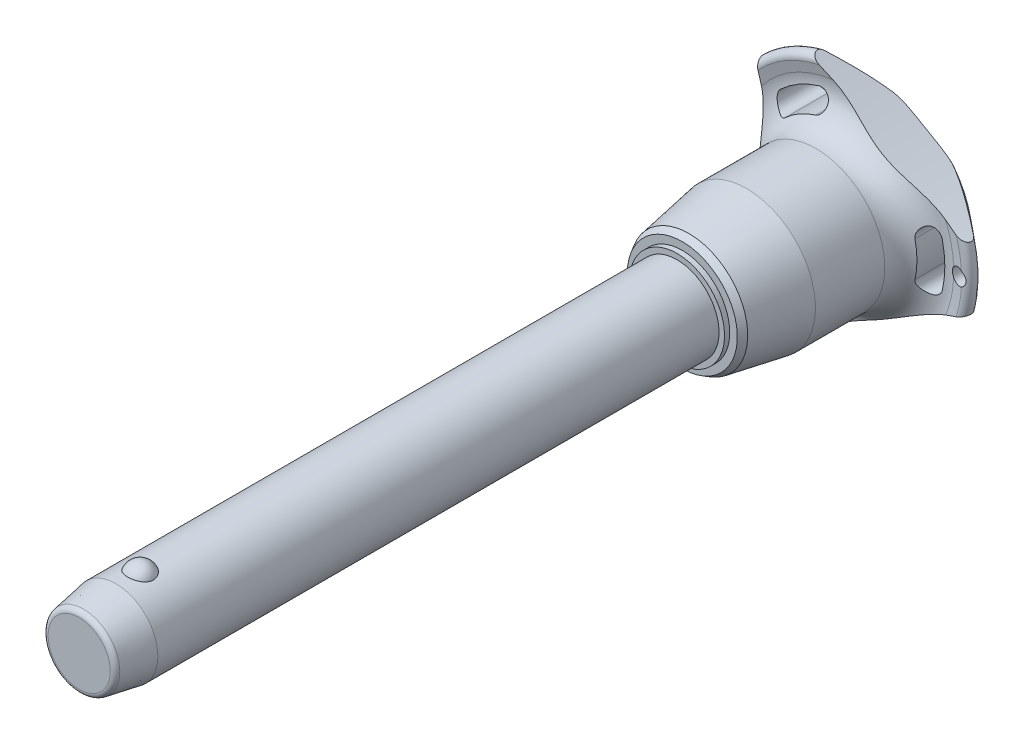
from build123d import *

# Parameters (mm, degrees)
SKETCH1_R           = 8
BOSS_EXTRUDE1_DEPTH = 100
SKETCH2_R           = 7
BOSS_EXTRUDE2_DEPTH = 39.7
BOSS_EXTRUDE3_START = 14
SKETCH1_2_R         = 8
BOSS_EXTRUDE3_DEPTH = 14
CHAMFER1_SIZE       = 7
CHAMFER1_SIZE2      = 1.234288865
FILLET1_R           = 1
SKETCH6_R           = 144.275
CUT_EXTRUDE1_DEPTH  = 144.700393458
CIRPATTERN1_COUNT   = 3
SKETCH7_R           = 1.5
CUT_EXTRUDE2_DEPTH  = 144.560667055


with BuildPart() as part:
    # Sketch1 → Boss-Extrude1 (new body)
    with BuildSketch(Plane.XY):
        Circle(SKETCH1_R)
    extrude(amount=-BOSS_EXTRUDE1_DEPTH)

    # Sketch2 → Boss-Extrude2 (add)
    with BuildSketch(Plane(origin=(0, 0, -100), x_dir=(-1, 0, 0), z_dir=(0, 0, -1))):
        Circle(SKETCH2_R)
    extrude(amount=BOSS_EXTRUDE2_DEPTH)

    # Sketch3 → Revolve1 (revolve)
    with BuildSketch(Plane(origin=(0, 0, 0), x_dir=(0, 0, -1), z_dir=(1, 0, 0))):
        with BuildLine():
            Line((-2.387467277, 9.5), (-2.387467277, 4.2))
            ThreePointArc((-2.387467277, 4.2), (0.262532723, 6.85), (-2.387467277, 9.5))
        make_face()
        with BuildLine():
            Line((-2.387467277, -4.2), (-2.387467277, -9.5))
            ThreePointArc((-2.387467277, -9.5), (0.262532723, -6.85), (-2.387467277, -4.2))
        make_face()
    revolve(axis=Axis((0, -4.2, 2.387467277), (0, 1, 0)))

    # Sketch1_2 → Boss-Extrude3 (add)
    with BuildSketch(Plane.XY.offset(BOSS_EXTRUDE3_START)):
        Circle(SKETCH1_2_R)
    extrude(amount=-BOSS_EXTRUDE3_DEPTH)

    # Chamfer1
    chamfer1_edges = [part.edges().sort_by_distance(p)[0] for p in [
        (-8, 0, 14),
    ]]
    chamfer1_side = [part.faces().sort_by_distance(p)[0] for p in [
        (-8, 0, -43),
    ]]
    chamfer(chamfer1_edges, length=CHAMFER1_SIZE, length2=CHAMFER1_SIZE2, reference=chamfer1_side[0])

    # Fillet1
    fillet1_edges = [part.edges().sort_by_distance(p)[0] for p in [
        (-6.765711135, 0, 14),
        (7, 0, -139.7),
    ]]
    fillet(fillet1_edges, radius=FILLET1_R)

    # Sketch4 → Revolve2 (revolve)
    with BuildSketch(Plane(origin=(0, 0, 0), x_dir=(0, 0, -1), z_dir=(1, 0, 0)), mode=Mode.PRIVATE) as revolve2_sk:
        Polygon((100, 0), (100, 9.044607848), (101, 9.044607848), (101, 10.490707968), (102.25235944, 11.213758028), (113.233333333, 13.15), (126.466666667, 13.15), (126.466666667, 0), align=None)
    revolve(revolve2_sk.sketch.rotate(Axis((0, 0, -126.466666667), (0, 0, 1)), 90), axis=Axis((0, 0, -126.466666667), (0, 0, 1)))

    # Sketch5 → Revolve3 (revolve)
    with BuildSketch(Plane(origin=(0, 0, 0), x_dir=(0, 0, -1), z_dir=(1, 0, 0)), mode=Mode.PRIVATE) as revolve3_sk:
        with BuildLine():
            Line((132.32877039, 20.428960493), (131.910912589, 22.344207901))
            ThreePointArc((131.910912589, 22.344207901), (132.554394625, 23.677136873), (134.002586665, 23.371345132))
            Line((134.002586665, 23.371345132), (139.141488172, 17.247040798))
            ThreePointArc((139.141488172, 17.247040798), (139.7, 15.584758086), (138.978803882, 13.986322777))
            ThreePointArc((138.978803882, 13.986322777), (134.617427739, 7.589034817), (133.083333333, 0))
            Line((133.083333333, 0), (126.466666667, 0))
            Line((126.466666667, 0), (126.466666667, 13.15))
            ThreePointArc((126.466666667, 13.15), (131.139661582, 15.38660811), (132.32877039, 20.428960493))
        make_face()
    revolve(revolve3_sk.sketch.rotate(Axis((0, 0, -133.083333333), (0, 0, 1)), 90), axis=Axis((0, 0, -133.083333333), (0, 0, 1)))

    # Sketch6 → Cut-Extrude1 (cut, through all)
    with BuildSketch(Plane.XY):
        with Locations((-159.975, 0)):
            Circle(SKETCH6_R)
        with BuildLine():
            ThreePointArc((18.131206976, -4.190753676), (18.60922037, 0), (18.131206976, 4.190753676))
            ThreePointArc((18.131206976, 4.190753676), (15.94840906, 5.553949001), (14.585213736, 3.371151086))
            ThreePointArc((14.585213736, 3.371151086), (14.969740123, 0), (14.585213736, -3.371151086))
            ThreePointArc((14.585213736, -3.371151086), (15.94840906, -5.553949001), (18.131206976, -4.190753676))
        make_face()
    cut_extrude1 = extrude(amount=-CUT_EXTRUDE1_DEPTH, mode=Mode.SUBTRACT)

    # CirPattern1: Cut-Extrude1 ×3 about axis
    cirpattern1_axis = Axis((0, 0, 0), (0, 0, 1))
    for i in range(1, CIRPATTERN1_COUNT):
        add(cut_extrude1.rotate(cirpattern1_axis, i * 360 / CIRPATTERN1_COUNT), mode=Mode.SUBTRACT)

    # Sketch7 → Cut-Extrude2 (cut, through all)
    with BuildSketch(Plane.XY):
        with Locations(Location((21.60922037, 0, 0), (0, 0, 297.620773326))):
            Circle(SKETCH7_R)
    extrude(amount=-CUT_EXTRUDE2_DEPTH, mode=Mode.SUBTRACT)


solid = part.part
